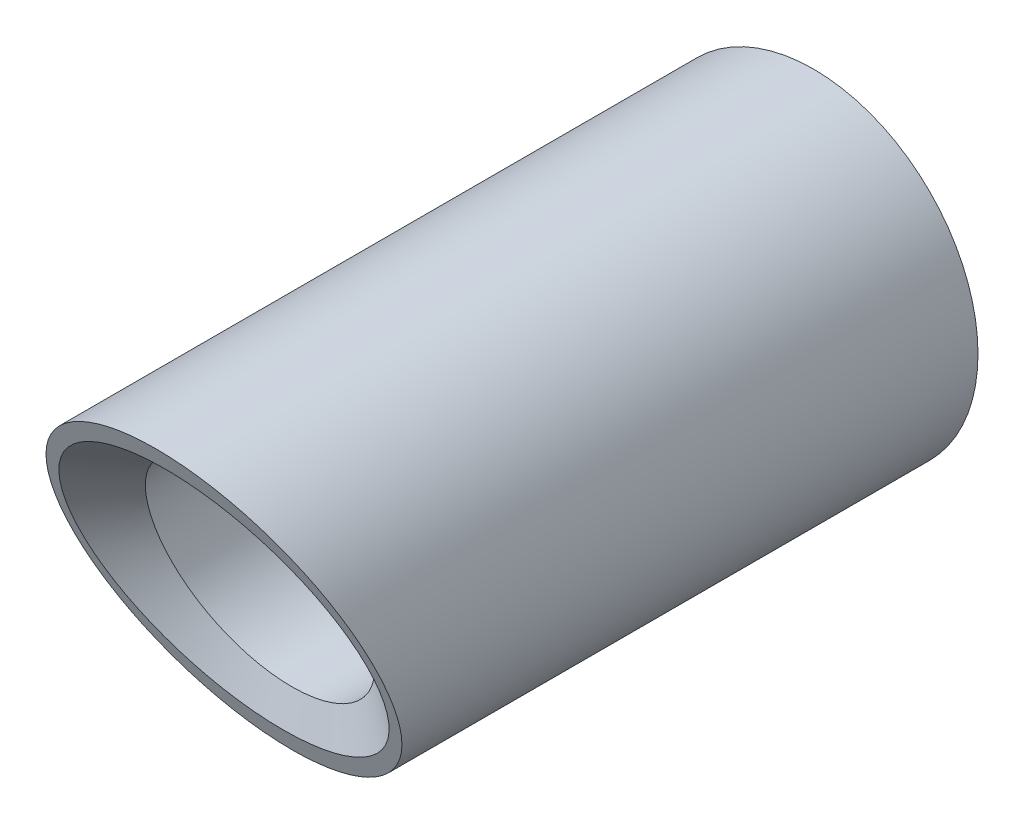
from build123d import *

# Parameters (mm, degrees)
SKIZZE1_R                            = 7.5
SKIZZE1_R_2                          = 5
LINEAR_AUSTRAGEN1_DEPTH              = 30
SCHNITT_LINEAR_AUSTRAGEN1_DEPTH      = 32.819805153
SCHNITT_LINEAR_AUSTRAGEN1_DEPTH_BACK = 32.819805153


with BuildPart() as part:
    # Skizze1 → Linear austragen1 (new body)
    with BuildSketch(Plane.XY):
        Circle(SKIZZE1_R)
        Circle(SKIZZE1_R_2, mode=Mode.SUBTRACT)
    extrude(amount=LINEAR_AUSTRAGEN1_DEPTH)

    # Skizze2 → Schnitt-Linear austragen1 (cut, two sides: drawn at the far end of the back side and taken through both)
    with BuildSketch(Plane(origin=(0, 0, 0), x_dir=(0, 0, -1), z_dir=(1, 0, 0)).offset(-SCHNITT_LINEAR_AUSTRAGEN1_DEPTH_BACK)):
        Polygon((-59.498019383, 78.714518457), (-30, 7.5), (-23.786796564, -7.5), (5.711222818, -78.714518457), (-136.717814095, -137.710557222), (-201.927056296, 19.718479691), align=None)
    extrude(amount=SCHNITT_LINEAR_AUSTRAGEN1_DEPTH + SCHNITT_LINEAR_AUSTRAGEN1_DEPTH_BACK, mode=Mode.SUBTRACT)

    # Skizze3 → Schnitt-Rotation1 (revolve, cut)
    with BuildSketch(Plane(origin=(0, 0, 0), x_dir=(0, 0, -1), z_dir=(1, 0, 0)), mode=Mode.PRIVATE) as schnitt_rotation1_sk:
        Polygon((-26.987710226, 5), (-29.585786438, 6.5), (-28.6749769, 4.301111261), align=None)
    revolve(schnitt_rotation1_sk.sketch.rotate(Axis((0, 0, 26.893398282), (0, 0.3826834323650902, -0.9238795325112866)), 180), axis=Axis((0, 0, 26.893398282), (0, 0.3826834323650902, -0.9238795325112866)), mode=Mode.SUBTRACT)


solid = part.part
